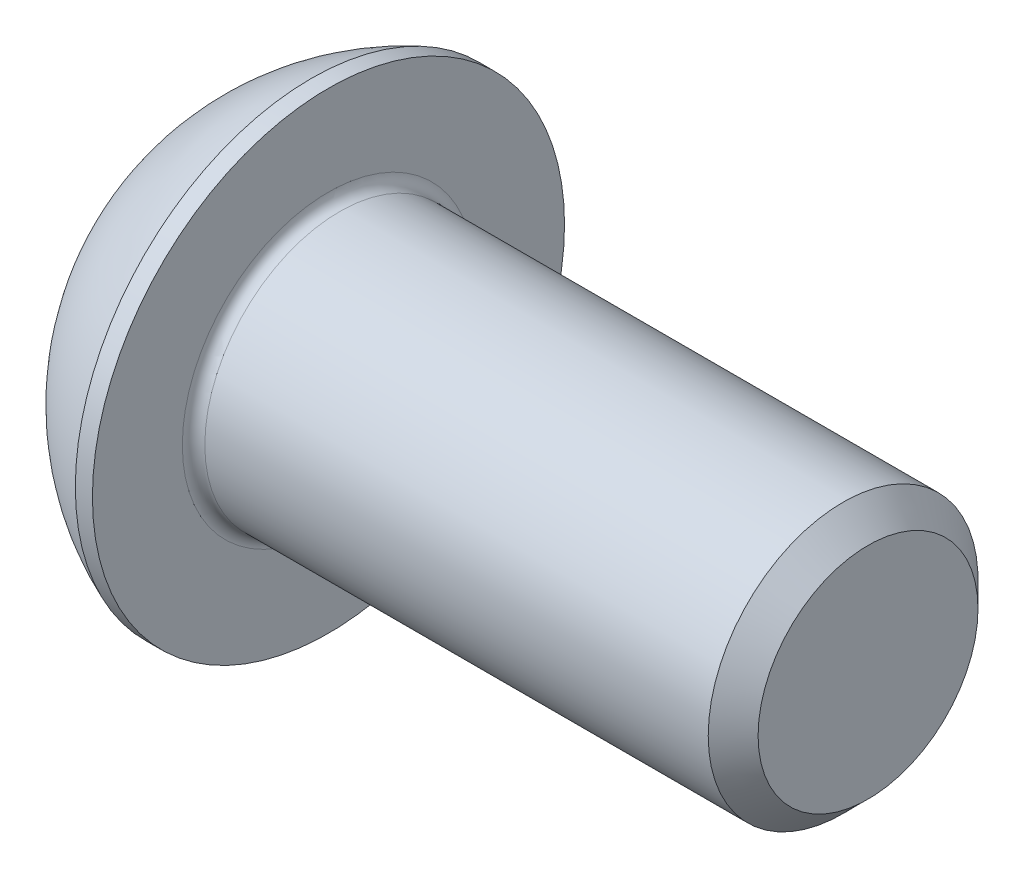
from build123d import *

# Parameters (mm, degrees)
FILLET1_R   = 0.25
HEX_2_DEPTH = 2.08


with BuildPart() as part:
    # BodySke → BaseBody (revolve)
    with BuildSketch(Plane.XY, mode=Mode.PRIVATE) as basebody_sk:
        with BuildLine():
            Line((15.3, 0), (15.3, 2.4455))
            Line((15.3, 2.4455), (14.7455, 3))
            Line((14.7455, 3), (3.3, 3))
            Line((3.3, 3), (3.3, 5.25))
            Line((3.3, 5.25), (2.92, 5.25))
            ThreePointArc((2.92, 5.25), (1.224500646, 4.199464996), (0, 2.625))
            Line((0, 2.625), (0, 0))
            Line((0, 0), (15.3, 0))
        make_face()
    revolve(basebody_sk.sketch.rotate(Axis((0, 0, 0), (1, 0, 0)), 90), axis=Axis((0, 0, 0), (1, 0, 0)))

    # Fillet1
    fillet1_edges = [part.edges().sort_by_distance(p)[0] for p in [
        (3.3, 0, -3),
    ]]
    fillet(fillet1_edges, radius=FILLET1_R)

    # Sketch2 → PreBroach (revolve, cut)
    with BuildSketch(Plane.XY, mode=Mode.PRIVATE) as prebroach_sk:
        Polygon((0, 2), (2.08, 2), (3.234700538, 0), (0, 0), align=None)
    revolve(prebroach_sk.sketch.rotate(Axis((0, 0, 0), (1, 0, 0)), 90), axis=Axis((0, 0, 0), (1, 0, 0)), mode=Mode.SUBTRACT)

    # Sketch3 → Hex 2 (cut)
    with BuildSketch(Plane(origin=(0, 0, 0), x_dir=(0, 0, -1), z_dir=(1, 0, 0))):
        Polygon((-2, -1.154700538), (-2, 1.154700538), (0, 2.309401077), (2, 1.154700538), (2, -1.154700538), (0, -2.309401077), align=None)
    extrude(amount=HEX_2_DEPTH, mode=Mode.SUBTRACT)


solid = part.part
